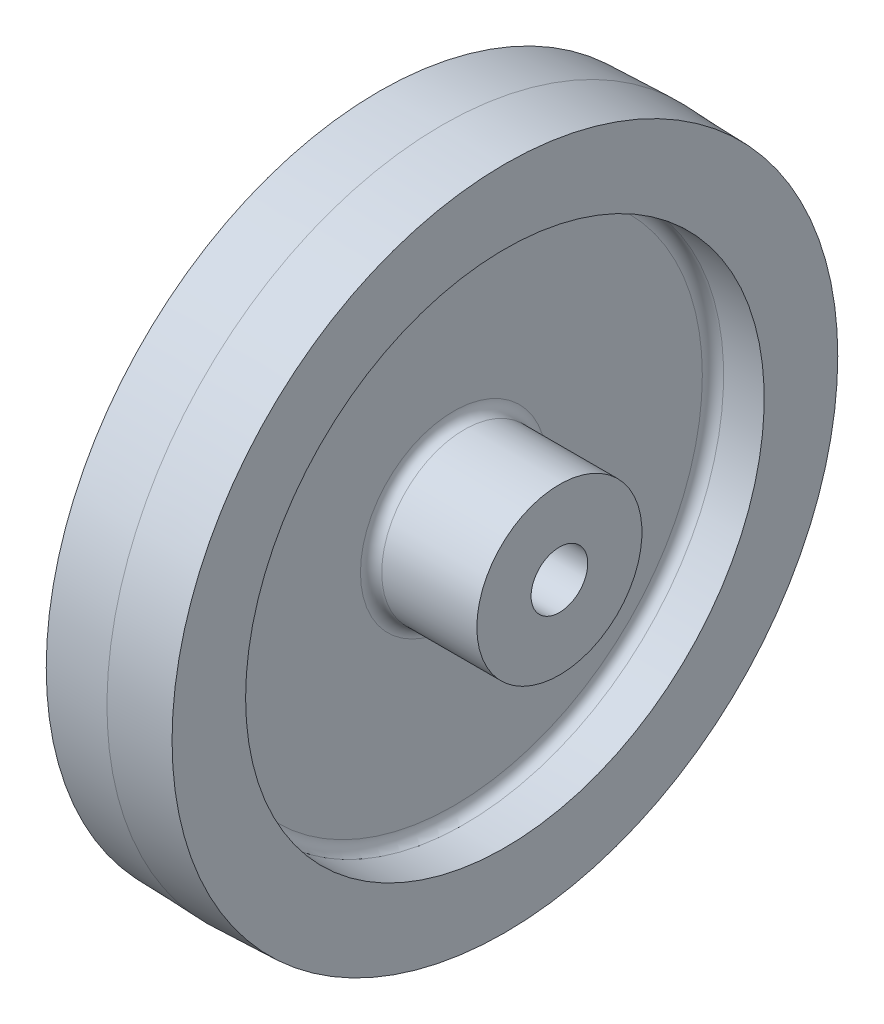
ISO-10303-21;
HEADER;
FILE_DESCRIPTION(('STEP AP214'),'2;1');
FILE_NAME('part.step','',(''),(''),'','','');
FILE_SCHEMA(('AUTOMOTIVE_DESIGN { 1 0 10303 214 1 1 1 1 }'));
ENDSEC;
DATA;
#1=APPLICATION_CONTEXT('core data for automotive mechanical design processes');
#2=APPLICATION_PROTOCOL_DEFINITION('international standard','automotive_design',2000,#1);
#3=PRODUCT_CONTEXT('',#1,'mechanical');
#4=PRODUCT('Part','Part','',(#3));
#5=PRODUCT_RELATED_PRODUCT_CATEGORY('part','',(#4));
#6=PRODUCT_DEFINITION_FORMATION('','',#4);
#7=PRODUCT_DEFINITION_CONTEXT('part definition',#1,'design');
#8=PRODUCT_DEFINITION('design','',#6,#7);
#9=PRODUCT_DEFINITION_SHAPE('','',#8);
#10=(LENGTH_UNIT() NAMED_UNIT(*) SI_UNIT(.MILLI.,.METRE.));
#11=(NAMED_UNIT(*) PLANE_ANGLE_UNIT() SI_UNIT($,.RADIAN.));
#12=(NAMED_UNIT(*) SI_UNIT($,.STERADIAN.) SOLID_ANGLE_UNIT());
#13=UNCERTAINTY_MEASURE_WITH_UNIT(LENGTH_MEASURE(1.E-05),#10,'distance_accuracy_value','');
#14=(GEOMETRIC_REPRESENTATION_CONTEXT(3) GLOBAL_UNCERTAINTY_ASSIGNED_CONTEXT((#13)) GLOBAL_UNIT_ASSIGNED_CONTEXT((#10,
#11,#12)) REPRESENTATION_CONTEXT('',''));
#15=CARTESIAN_POINT('',(0.,0.,0.));
#16=DIRECTION('',(0.,0.,1.));
#17=DIRECTION('',(1.,0.,0.));
#18=AXIS2_PLACEMENT_3D('',#15,#16,#17);
#19=CARTESIAN_POINT('',(0.,8.395,0.));
#20=DIRECTION('',(1.,0.,0.));
#21=DIRECTION('',(0.,0.,1.));
#22=AXIS2_PLACEMENT_3D('',#19,#20,#21);
#23=CONICAL_SURFACE('',#22,314.67,0.0349065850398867);
#24=CARTESIAN_POINT('',(-59.085,8.395,0.));
#25=DIRECTION('',(1.,0.,0.));
#26=DIRECTION('',(0.,0.,-1.));
#27=AXIS2_PLACEMENT_3D('',#24,#25,#26);
#28=CIRCLE('',#27,312.60670633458);
#29=CARTESIAN_POINT('',(-59.085,8.395,-312.60670633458));
#30=VERTEX_POINT('',#29);
#31=EDGE_CURVE('E50',#30,#30,#28,.F.);
#32=ORIENTED_EDGE('',*,*,#31,.F.);
#33=EDGE_LOOP('',(#32));
#34=FACE_BOUND('',#33,.T.);
#35=CARTESIAN_POINT('',(1.11022302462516E-13,8.395,0.));
#36=DIRECTION('',(1.,0.,0.));
#37=DIRECTION('',(0.,1.,0.));
#38=AXIS2_PLACEMENT_3D('',#35,#36,#37);
#39=CIRCLE('',#38,314.67);
#40=CARTESIAN_POINT('',(1.14162454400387E-13,323.065,0.));
#41=VERTEX_POINT('',#40);
#42=EDGE_CURVE('E10',#41,#41,#39,.T.);
#43=ORIENTED_EDGE('',*,*,#42,.F.);
#44=EDGE_LOOP('',(#43));
#45=FACE_BOUND('',#44,.T.);
#46=ADVANCED_FACE('F31',(#34,#45),#23,.T.);
#47=CARTESIAN_POINT('',(-110.26,85.94,0.));
#48=DIRECTION('',(1.,0.,0.));
#49=DIRECTION('',(0.,0.,-1.));
#50=AXIS2_PLACEMENT_3D('',#47,#48,#49);
#51=PLANE('',#50);
#52=CARTESIAN_POINT('',(-110.26,8.395,0.));
#53=DIRECTION('',(-1.,0.,0.));
#54=DIRECTION('',(0.,0.,1.));
#55=AXIS2_PLACEMENT_3D('',#52,#53,#54);
#56=CIRCLE('',#55,26.605);
#57=CARTESIAN_POINT('',(-110.26,8.395,26.605));
#58=VERTEX_POINT('',#57);
#59=EDGE_CURVE('E285',#58,#58,#56,.T.);
#60=ORIENTED_EDGE('',*,*,#59,.F.);
#61=EDGE_LOOP('',(#60));
#62=FACE_BOUND('',#61,.T.);
#63=CARTESIAN_POINT('',(-110.26,8.395,0.));
#64=DIRECTION('',(-1.,0.,0.));
#65=DIRECTION('',(0.,0.,1.));
#66=AXIS2_PLACEMENT_3D('',#63,#64,#65);
#67=CIRCLE('',#66,77.545);
#68=CARTESIAN_POINT('',(-110.26,8.395,77.545));
#69=VERTEX_POINT('',#68);
#70=EDGE_CURVE('E56',#69,#69,#67,.T.);
#71=ORIENTED_EDGE('',*,*,#70,.T.);
#72=EDGE_LOOP('',(#71));
#73=FACE_BOUND('',#72,.T.);
#74=ADVANCED_FACE('F110',(#62,#73),#51,.F.);
#75=CARTESIAN_POINT('',(-110.297539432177,8.395,0.));
#76=DIRECTION('',(-1.,0.,0.));
#77=DIRECTION('',(0.,0.,1.));
#78=AXIS2_PLACEMENT_3D('',#75,#76,#77);
#79=CYLINDRICAL_SURFACE('',#78,77.545);
#80=CARTESIAN_POINT('',(-20.965,8.395,0.));
#81=DIRECTION('',(1.,0.,0.));
#82=DIRECTION('',(0.,0.,-1.));
#83=AXIS2_PLACEMENT_3D('',#80,#81,#82);
#84=CIRCLE('',#83,77.545);
#85=CARTESIAN_POINT('',(-20.965,8.395,-77.545));
#86=VERTEX_POINT('',#85);
#87=EDGE_CURVE('E74',#86,#86,#84,.F.);
#88=ORIENTED_EDGE('',*,*,#87,.T.);
#89=EDGE_LOOP('',(#88));
#90=FACE_BOUND('',#89,.T.);
#91=ORIENTED_EDGE('',*,*,#70,.F.);
#92=EDGE_LOOP('',(#91));
#93=FACE_BOUND('',#92,.T.);
#94=ADVANCED_FACE('F115',(#90,#93),#79,.T.);
#95=CARTESIAN_POINT('',(-10.965,251.925,0.));
#96=DIRECTION('',(1.,0.,0.));
#97=DIRECTION('',(0.,0.,-1.));
#98=AXIS2_PLACEMENT_3D('',#95,#96,#97);
#99=PLANE('',#98);
#100=CARTESIAN_POINT('',(-10.965,8.395,0.));
#101=DIRECTION('',(1.,0.,0.));
#102=DIRECTION('',(0.,0.,-1.));
#103=AXIS2_PLACEMENT_3D('',#100,#101,#102);
#104=CIRCLE('',#103,233.53);
#105=CARTESIAN_POINT('',(-10.965,8.395,-233.53));
#106=VERTEX_POINT('',#105);
#107=EDGE_CURVE('E80',#106,#106,#104,.F.);
#108=ORIENTED_EDGE('',*,*,#107,.T.);
#109=EDGE_LOOP('',(#108));
#110=FACE_BOUND('',#109,.T.);
#111=CARTESIAN_POINT('',(-10.965,8.395,0.));
#112=DIRECTION('',(1.,0.,0.));
#113=DIRECTION('',(0.,0.,-1.));
#114=AXIS2_PLACEMENT_3D('',#111,#112,#113);
#115=CIRCLE('',#114,87.545);
#116=CARTESIAN_POINT('',(-10.965,8.395,-87.545));
#117=VERTEX_POINT('',#116);
#118=EDGE_CURVE('E77',#117,#117,#115,.T.);
#119=ORIENTED_EDGE('',*,*,#118,.T.);
#120=EDGE_LOOP('',(#119));
#121=FACE_BOUND('',#120,.T.);
#122=ADVANCED_FACE('F122',(#110,#121),#99,.F.);
#123=CARTESIAN_POINT('',(-110.297539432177,8.395,0.));
#124=DIRECTION('',(-1.,0.,0.));
#125=DIRECTION('',(0.,0.,1.));
#126=AXIS2_PLACEMENT_3D('',#123,#124,#125);
#127=CYLINDRICAL_SURFACE('',#126,243.53);
#128=CARTESIAN_POINT('',(-20.965,8.395,0.));
#129=DIRECTION('',(1.,0.,0.));
#130=DIRECTION('',(0.,0.,-1.));
#131=AXIS2_PLACEMENT_3D('',#128,#129,#130);
#132=CIRCLE('',#131,243.53);
#133=CARTESIAN_POINT('',(-20.965,8.395,-243.53));
#134=VERTEX_POINT('',#133);
#135=EDGE_CURVE('E83',#134,#134,#132,.T.);
#136=ORIENTED_EDGE('',*,*,#135,.T.);
#137=EDGE_LOOP('',(#136));
#138=FACE_BOUND('',#137,.T.);
#139=CARTESIAN_POINT('',(-59.085,8.395,0.));
#140=DIRECTION('',(-1.,0.,0.));
#141=DIRECTION('',(0.,0.,1.));
#142=AXIS2_PLACEMENT_3D('',#139,#140,#141);
#143=CIRCLE('',#142,243.53);
#144=CARTESIAN_POINT('',(-59.085,8.395,243.53));
#145=VERTEX_POINT('',#144);
#146=EDGE_CURVE('E52',#145,#145,#143,.T.);
#147=ORIENTED_EDGE('',*,*,#146,.T.);
#148=EDGE_LOOP('',(#147));
#149=FACE_BOUND('',#148,.T.);
#150=ADVANCED_FACE('F126',(#138,#149),#127,.F.);
#151=CARTESIAN_POINT('',(-59.085,323.065,0.));
#152=DIRECTION('',(1.,0.,0.));
#153=DIRECTION('',(0.,0.,-1.));
#154=AXIS2_PLACEMENT_3D('',#151,#152,#153);
#155=PLANE('',#154);
#156=ORIENTED_EDGE('',*,*,#146,.F.);
#157=EDGE_LOOP('',(#156));
#158=FACE_BOUND('',#157,.T.);
#159=ORIENTED_EDGE('',*,*,#31,.T.);
#160=EDGE_LOOP('',(#159));
#161=FACE_BOUND('',#160,.T.);
#162=ADVANCED_FACE('F130',(#158,#161),#155,.F.);
#163=CARTESIAN_POINT('',(0.,8.395,0.));
#164=DIRECTION('',(-1.,0.,0.));
#165=DIRECTION('',(0.,0.,-1.));
#166=AXIS2_PLACEMENT_3D('',#163,#164,#165);
#167=CONICAL_SURFACE('',#166,314.67,0.0349065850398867);
#168=ORIENTED_EDGE('',*,*,#42,.T.);
#169=EDGE_LOOP('',(#168));
#170=FACE_BOUND('',#169,.T.);
#171=CARTESIAN_POINT('',(59.085,8.395,0.));
#172=DIRECTION('',(-1.,0.,0.));
#173=DIRECTION('',(0.,0.,1.));
#174=AXIS2_PLACEMENT_3D('',#171,#172,#173);
#175=CIRCLE('',#174,312.60670633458);
#176=CARTESIAN_POINT('',(59.085,8.395,312.60670633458));
#177=VERTEX_POINT('',#176);
#178=EDGE_CURVE('E35',#177,#177,#175,.T.);
#179=ORIENTED_EDGE('',*,*,#178,.T.);
#180=EDGE_LOOP('',(#179));
#181=FACE_BOUND('',#180,.T.);
#182=ADVANCED_FACE('F33',(#170,#181),#167,.T.);
#183=CARTESIAN_POINT('',(59.085,251.925,0.));
#184=DIRECTION('',(-1.,0.,0.));
#185=DIRECTION('',(0.,0.,1.));
#186=AXIS2_PLACEMENT_3D('',#183,#184,#185);
#187=PLANE('',#186);
#188=ORIENTED_EDGE('',*,*,#178,.F.);
#189=EDGE_LOOP('',(#188));
#190=FACE_BOUND('',#189,.T.);
#191=CARTESIAN_POINT('',(59.085,8.395,0.));
#192=DIRECTION('',(-1.,0.,0.));
#193=DIRECTION('',(0.,0.,1.));
#194=AXIS2_PLACEMENT_3D('',#191,#192,#193);
#195=CIRCLE('',#194,243.53);
#196=CARTESIAN_POINT('',(59.085,8.395,243.53));
#197=VERTEX_POINT('',#196);
#198=EDGE_CURVE('E59',#197,#197,#195,.T.);
#199=ORIENTED_EDGE('',*,*,#198,.T.);
#200=EDGE_LOOP('',(#199));
#201=FACE_BOUND('',#200,.T.);
#202=ADVANCED_FACE('F135',(#190,#201),#187,.F.);
#203=CARTESIAN_POINT('',(-110.297539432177,8.395,0.));
#204=DIRECTION('',(-1.,0.,0.));
#205=DIRECTION('',(0.,0.,1.));
#206=AXIS2_PLACEMENT_3D('',#203,#204,#205);
#207=CYLINDRICAL_SURFACE('',#206,243.53);
#208=CARTESIAN_POINT('',(20.965,8.395,0.));
#209=DIRECTION('',(-1.,0.,0.));
#210=DIRECTION('',(0.,0.,1.));
#211=AXIS2_PLACEMENT_3D('',#208,#209,#210);
#212=CIRCLE('',#211,243.53);
#213=CARTESIAN_POINT('',(20.965,8.395,243.53));
#214=VERTEX_POINT('',#213);
#215=EDGE_CURVE('E86',#214,#214,#212,.T.);
#216=ORIENTED_EDGE('',*,*,#215,.T.);
#217=EDGE_LOOP('',(#216));
#218=FACE_BOUND('',#217,.T.);
#219=ORIENTED_EDGE('',*,*,#198,.F.);
#220=EDGE_LOOP('',(#219));
#221=FACE_BOUND('',#220,.T.);
#222=ADVANCED_FACE('F138',(#218,#221),#207,.F.);
#223=CARTESIAN_POINT('',(10.965,85.94,0.));
#224=DIRECTION('',(-1.,0.,0.));
#225=DIRECTION('',(0.,0.,1.));
#226=AXIS2_PLACEMENT_3D('',#223,#224,#225);
#227=PLANE('',#226);
#228=CARTESIAN_POINT('',(10.965,8.395,0.));
#229=DIRECTION('',(-1.,0.,0.));
#230=DIRECTION('',(0.,0.,1.));
#231=AXIS2_PLACEMENT_3D('',#228,#229,#230);
#232=CIRCLE('',#231,87.545);
#233=CARTESIAN_POINT('',(10.965,8.395,87.545));
#234=VERTEX_POINT('',#233);
#235=EDGE_CURVE('E47',#234,#234,#232,.T.);
#236=ORIENTED_EDGE('',*,*,#235,.T.);
#237=EDGE_LOOP('',(#236));
#238=FACE_BOUND('',#237,.T.);
#239=CARTESIAN_POINT('',(10.965,8.395,0.));
#240=DIRECTION('',(-1.,0.,0.));
#241=DIRECTION('',(0.,0.,1.));
#242=AXIS2_PLACEMENT_3D('',#239,#240,#241);
#243=CIRCLE('',#242,233.53);
#244=CARTESIAN_POINT('',(10.965,8.395,233.53));
#245=VERTEX_POINT('',#244);
#246=EDGE_CURVE('E89',#245,#245,#243,.F.);
#247=ORIENTED_EDGE('',*,*,#246,.T.);
#248=EDGE_LOOP('',(#247));
#249=FACE_BOUND('',#248,.T.);
#250=ADVANCED_FACE('F94',(#238,#249),#227,.F.);
#251=CARTESIAN_POINT('',(-110.297539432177,8.395,0.));
#252=DIRECTION('',(-1.,0.,0.));
#253=DIRECTION('',(0.,0.,1.));
#254=AXIS2_PLACEMENT_3D('',#251,#252,#253);
#255=CYLINDRICAL_SURFACE('',#254,77.545);
#256=CARTESIAN_POINT('',(20.965,8.395,0.));
#257=DIRECTION('',(-1.,0.,0.));
#258=DIRECTION('',(0.,0.,1.));
#259=AXIS2_PLACEMENT_3D('',#256,#257,#258);
#260=CIRCLE('',#259,77.545);
#261=CARTESIAN_POINT('',(20.965,8.395,77.545));
#262=VERTEX_POINT('',#261);
#263=EDGE_CURVE('E40',#262,#262,#260,.F.);
#264=ORIENTED_EDGE('',*,*,#263,.T.);
#265=EDGE_LOOP('',(#264));
#266=FACE_BOUND('',#265,.T.);
#267=CARTESIAN_POINT('',(110.26,8.395,0.));
#268=DIRECTION('',(-1.,0.,0.));
#269=DIRECTION('',(0.,0.,1.));
#270=AXIS2_PLACEMENT_3D('',#267,#268,#269);
#271=CIRCLE('',#270,77.545);
#272=CARTESIAN_POINT('',(110.26,8.395,77.545));
#273=VERTEX_POINT('',#272);
#274=EDGE_CURVE('E63',#273,#273,#271,.T.);
#275=ORIENTED_EDGE('',*,*,#274,.T.);
#276=EDGE_LOOP('',(#275));
#277=FACE_BOUND('',#276,.T.);
#278=ADVANCED_FACE('F145',(#266,#277),#255,.T.);
#279=CARTESIAN_POINT('',(110.26,35.,0.));
#280=DIRECTION('',(-1.,0.,0.));
#281=DIRECTION('',(0.,0.,1.));
#282=AXIS2_PLACEMENT_3D('',#279,#280,#281);
#283=PLANE('',#282);
#284=ORIENTED_EDGE('',*,*,#274,.F.);
#285=EDGE_LOOP('',(#284));
#286=FACE_BOUND('',#285,.T.);
#287=CARTESIAN_POINT('',(110.26,8.395,0.));
#288=DIRECTION('',(-1.,0.,0.));
#289=DIRECTION('',(0.,0.,1.));
#290=AXIS2_PLACEMENT_3D('',#287,#288,#289);
#291=CIRCLE('',#290,26.605);
#292=CARTESIAN_POINT('',(110.26,8.395,26.605));
#293=VERTEX_POINT('',#292);
#294=EDGE_CURVE('E68',#293,#293,#291,.T.);
#295=ORIENTED_EDGE('',*,*,#294,.T.);
#296=EDGE_LOOP('',(#295));
#297=FACE_BOUND('',#296,.T.);
#298=ADVANCED_FACE('F148',(#286,#297),#283,.F.);
#299=CARTESIAN_POINT('',(-110.297539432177,8.395,0.));
#300=DIRECTION('',(-1.,0.,0.));
#301=DIRECTION('',(0.,0.,1.));
#302=AXIS2_PLACEMENT_3D('',#299,#300,#301);
#303=CYLINDRICAL_SURFACE('',#302,26.605);
#304=ORIENTED_EDGE('',*,*,#294,.F.);
#305=EDGE_LOOP('',(#304));
#306=FACE_BOUND('',#305,.T.);
#307=ORIENTED_EDGE('',*,*,#59,.T.);
#308=EDGE_LOOP('',(#307));
#309=FACE_BOUND('',#308,.T.);
#310=ADVANCED_FACE('F152',(#306,#309),#303,.F.);
#311=CARTESIAN_POINT('',(-20.965,8.395,0.));
#312=DIRECTION('',(1.,0.,0.));
#313=DIRECTION('',(0.,0.,-1.));
#314=AXIS2_PLACEMENT_3D('',#311,#312,#313);
#315=TOROIDAL_SURFACE('',#314,87.545,10.);
#316=ORIENTED_EDGE('',*,*,#118,.F.);
#317=EDGE_LOOP('',(#316));
#318=FACE_BOUND('',#317,.T.);
#319=ORIENTED_EDGE('',*,*,#87,.F.);
#320=EDGE_LOOP('',(#319));
#321=FACE_BOUND('',#320,.T.);
#322=ADVANCED_FACE('F156',(#318,#321),#315,.F.);
#323=CARTESIAN_POINT('',(-20.965,8.395,0.));
#324=DIRECTION('',(1.,0.,0.));
#325=DIRECTION('',(0.,0.,-1.));
#326=AXIS2_PLACEMENT_3D('',#323,#324,#325);
#327=TOROIDAL_SURFACE('',#326,233.53,10.);
#328=ORIENTED_EDGE('',*,*,#135,.F.);
#329=EDGE_LOOP('',(#328));
#330=FACE_BOUND('',#329,.T.);
#331=ORIENTED_EDGE('',*,*,#107,.F.);
#332=EDGE_LOOP('',(#331));
#333=FACE_BOUND('',#332,.T.);
#334=ADVANCED_FACE('F105',(#330,#333),#327,.F.);
#335=CARTESIAN_POINT('',(20.965,8.395,0.));
#336=DIRECTION('',(-1.,0.,0.));
#337=DIRECTION('',(0.,0.,1.));
#338=AXIS2_PLACEMENT_3D('',#335,#336,#337);
#339=TOROIDAL_SURFACE('',#338,233.53,10.);
#340=ORIENTED_EDGE('',*,*,#246,.F.);
#341=EDGE_LOOP('',(#340));
#342=FACE_BOUND('',#341,.T.);
#343=ORIENTED_EDGE('',*,*,#215,.F.);
#344=EDGE_LOOP('',(#343));
#345=FACE_BOUND('',#344,.T.);
#346=ADVANCED_FACE('F99',(#342,#345),#339,.F.);
#347=CARTESIAN_POINT('',(20.965,8.395,0.));
#348=DIRECTION('',(-1.,0.,0.));
#349=DIRECTION('',(0.,0.,1.));
#350=AXIS2_PLACEMENT_3D('',#347,#348,#349);
#351=TOROIDAL_SURFACE('',#350,87.545,10.);
#352=ORIENTED_EDGE('',*,*,#263,.F.);
#353=EDGE_LOOP('',(#352));
#354=FACE_BOUND('',#353,.T.);
#355=ORIENTED_EDGE('',*,*,#235,.F.);
#356=EDGE_LOOP('',(#355));
#357=FACE_BOUND('',#356,.T.);
#358=ADVANCED_FACE('F97',(#354,#357),#351,.F.);
#359=CLOSED_SHELL('',(#46,#74,#94,#122,#150,#162,#182,#202,#222,#250,#278,#298,#310,#322,#334,
#346,#358));
#360=MANIFOLD_SOLID_BREP('B2',#359);
#361=ADVANCED_BREP_SHAPE_REPRESENTATION('',(#18,#360),#14);
#362=SHAPE_DEFINITION_REPRESENTATION(#9,#361);
ENDSEC;
END-ISO-10303-21;
